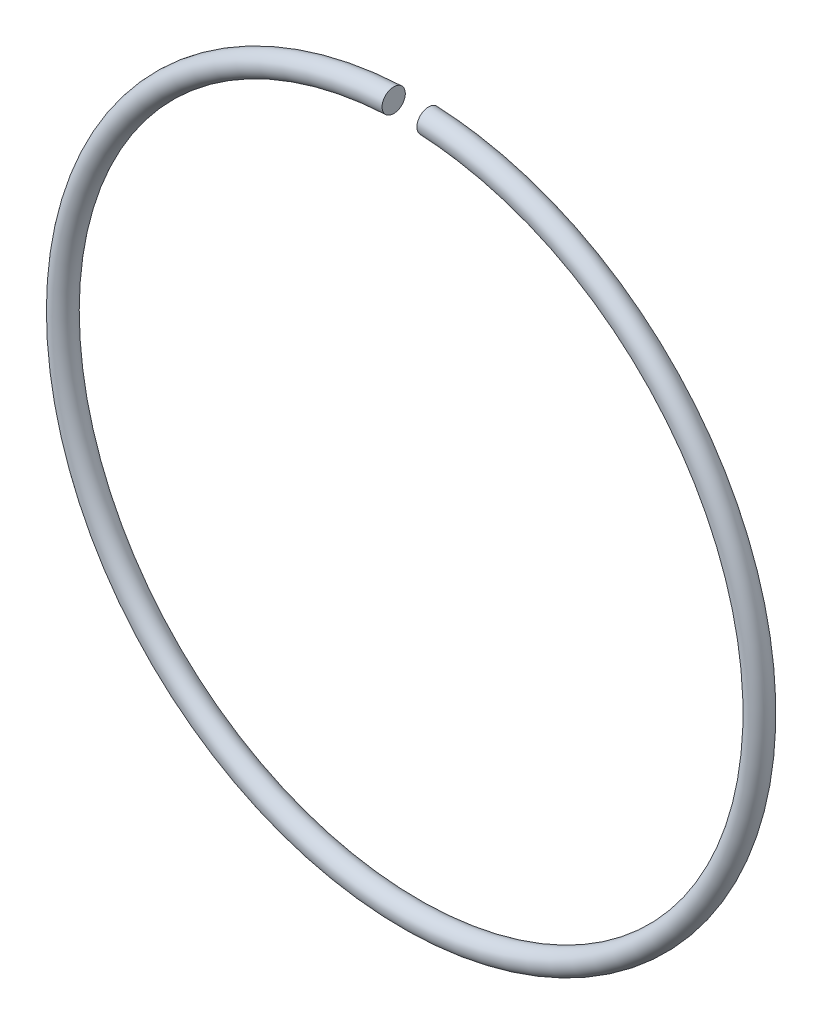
from build123d import *

# Parameters (mm, degrees)
ESQUISSE1_R             = 0.4999999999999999
ENL_V_MAT_EXTRU_1_DEPTH = 0.5


with BuildPart() as part:
    # Esquisse1 → R_volution1 (revolve)
    with BuildSketch(Plane(origin=(0, 0, 0), x_dir=(0, 0, -1), z_dir=(1, 0, 0)), mode=Mode.PRIVATE) as r_volution1_sk:
        with Locations((0, 15)):
            Circle(ESQUISSE1_R)
    revolve(r_volution1_sk.sketch.rotate(Axis((0, 0, 2.394029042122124), (0, 0, -1)), 90), axis=Axis((0, 0, 2.394029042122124), (0, 0, -1)))

    # Esquisse2 → Enl_v. mat.-Extru.1 (cut, symmetric)
    with BuildSketch(Plane.XY):
        Polygon((-0.7500000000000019, 14.183673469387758), (-0.7500000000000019, 16.812169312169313), (0.7500000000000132, 16.812169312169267), (0.7499999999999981, 14.183673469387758), (0.7499999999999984, 12.091836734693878), (-0.7500000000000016, 12.091836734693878), align=None)
    extrude(amount=ENL_V_MAT_EXTRU_1_DEPTH, both=True, mode=Mode.SUBTRACT)


solid = part.part
